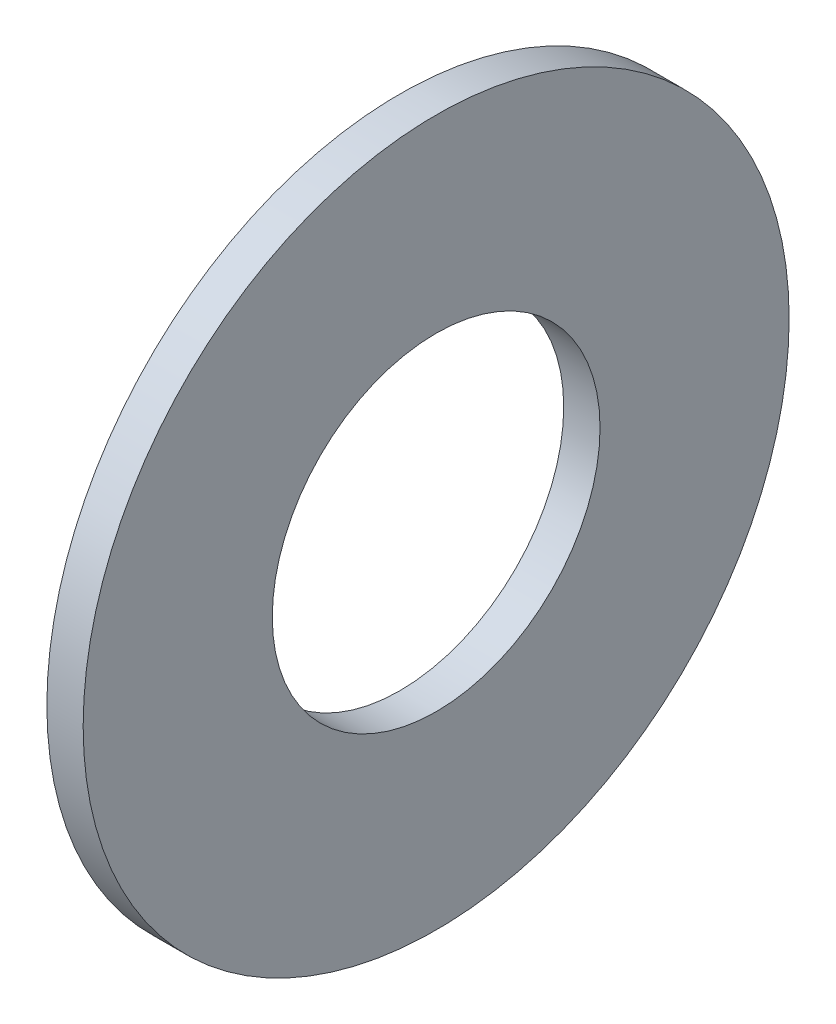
ISO-10303-21;
HEADER;
FILE_DESCRIPTION(('STEP AP214'),'2;1');
FILE_NAME('part.step','',(''),(''),'','','');
FILE_SCHEMA(('AUTOMOTIVE_DESIGN { 1 0 10303 214 1 1 1 1 }'));
ENDSEC;
DATA;
#1=APPLICATION_CONTEXT('core data for automotive mechanical design processes');
#2=APPLICATION_PROTOCOL_DEFINITION('international standard','automotive_design',2000,#1);
#3=PRODUCT_CONTEXT('',#1,'mechanical');
#4=PRODUCT('Part','Part','',(#3));
#5=PRODUCT_RELATED_PRODUCT_CATEGORY('part','',(#4));
#6=PRODUCT_DEFINITION_FORMATION('','',#4);
#7=PRODUCT_DEFINITION_CONTEXT('part definition',#1,'design');
#8=PRODUCT_DEFINITION('design','',#6,#7);
#9=PRODUCT_DEFINITION_SHAPE('','',#8);
#10=(LENGTH_UNIT() NAMED_UNIT(*) SI_UNIT(.MILLI.,.METRE.));
#11=(NAMED_UNIT(*) PLANE_ANGLE_UNIT() SI_UNIT($,.RADIAN.));
#12=(NAMED_UNIT(*) SI_UNIT($,.STERADIAN.) SOLID_ANGLE_UNIT());
#13=UNCERTAINTY_MEASURE_WITH_UNIT(LENGTH_MEASURE(1.E-05),#10,'distance_accuracy_value','');
#14=(GEOMETRIC_REPRESENTATION_CONTEXT(3) GLOBAL_UNCERTAINTY_ASSIGNED_CONTEXT((#13)) GLOBAL_UNIT_ASSIGNED_CONTEXT((#10,
#11,#12)) REPRESENTATION_CONTEXT('',''));
#15=CARTESIAN_POINT('',(0.,0.,0.));
#16=DIRECTION('',(0.,0.,1.));
#17=DIRECTION('',(1.,0.,0.));
#18=AXIS2_PLACEMENT_3D('',#15,#16,#17);
#19=CARTESIAN_POINT('',(-34.9249999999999,0.,0.));
#20=DIRECTION('',(-1.,0.,0.));
#21=DIRECTION('',(0.,0.,1.));
#22=AXIS2_PLACEMENT_3D('',#19,#20,#21);
#23=CYLINDRICAL_SURFACE('',#22,20.6375);
#24=CARTESIAN_POINT('',(0.,0.,0.));
#25=DIRECTION('',(-1.,0.,0.));
#26=DIRECTION('',(0.,0.,1.));
#27=AXIS2_PLACEMENT_3D('',#24,#25,#26);
#28=CIRCLE('',#27,20.6375);
#29=CARTESIAN_POINT('',(0.,0.,20.6375));
#30=VERTEX_POINT('',#29);
#31=EDGE_CURVE('E10',#30,#30,#28,.T.);
#32=ORIENTED_EDGE('',*,*,#31,.F.);
#33=EDGE_LOOP('',(#32));
#34=FACE_BOUND('',#33,.T.);
#35=CARTESIAN_POINT('',(-4.572,0.,0.));
#36=DIRECTION('',(-1.,0.,0.));
#37=DIRECTION('',(0.,0.,1.));
#38=AXIS2_PLACEMENT_3D('',#35,#36,#37);
#39=CIRCLE('',#38,20.6375);
#40=CARTESIAN_POINT('',(-4.572,0.,20.6375));
#41=VERTEX_POINT('',#40);
#42=EDGE_CURVE('E44',#41,#41,#39,.T.);
#43=ORIENTED_EDGE('',*,*,#42,.T.);
#44=EDGE_LOOP('',(#43));
#45=FACE_BOUND('',#44,.T.);
#46=ADVANCED_FACE('F30',(#34,#45),#23,.F.);
#47=CARTESIAN_POINT('',(0.,20.6375,0.));
#48=DIRECTION('',(-1.,0.,0.));
#49=DIRECTION('',(0.,0.,1.));
#50=AXIS2_PLACEMENT_3D('',#47,#48,#49);
#51=PLANE('',#50);
#52=CARTESIAN_POINT('',(0.,0.,0.));
#53=DIRECTION('',(-1.,0.,0.));
#54=DIRECTION('',(0.,0.,1.));
#55=AXIS2_PLACEMENT_3D('',#52,#53,#54);
#56=CIRCLE('',#55,44.45);
#57=CARTESIAN_POINT('',(0.,0.,44.45));
#58=VERTEX_POINT('',#57);
#59=EDGE_CURVE('E36',#58,#58,#56,.T.);
#60=ORIENTED_EDGE('',*,*,#59,.F.);
#61=EDGE_LOOP('',(#60));
#62=FACE_BOUND('',#61,.T.);
#63=ORIENTED_EDGE('',*,*,#31,.T.);
#64=EDGE_LOOP('',(#63));
#65=FACE_BOUND('',#64,.T.);
#66=ADVANCED_FACE('F59',(#62,#65),#51,.F.);
#67=CARTESIAN_POINT('',(-34.9249999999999,0.,0.));
#68=DIRECTION('',(-1.,0.,0.));
#69=DIRECTION('',(0.,0.,1.));
#70=AXIS2_PLACEMENT_3D('',#67,#68,#69);
#71=CYLINDRICAL_SURFACE('',#70,44.45);
#72=CARTESIAN_POINT('',(-4.572,0.,0.));
#73=DIRECTION('',(-1.,0.,0.));
#74=DIRECTION('',(0.,0.,1.));
#75=AXIS2_PLACEMENT_3D('',#72,#73,#74);
#76=CIRCLE('',#75,44.45);
#77=CARTESIAN_POINT('',(-4.572,0.,44.45));
#78=VERTEX_POINT('',#77);
#79=EDGE_CURVE('E40',#78,#78,#76,.T.);
#80=ORIENTED_EDGE('',*,*,#79,.F.);
#81=EDGE_LOOP('',(#80));
#82=FACE_BOUND('',#81,.T.);
#83=ORIENTED_EDGE('',*,*,#59,.T.);
#84=EDGE_LOOP('',(#83));
#85=FACE_BOUND('',#84,.T.);
#86=ADVANCED_FACE('F54',(#82,#85),#71,.T.);
#87=CARTESIAN_POINT('',(-4.572,44.45,0.));
#88=DIRECTION('',(1.,0.,0.));
#89=DIRECTION('',(0.,0.,-1.));
#90=AXIS2_PLACEMENT_3D('',#87,#88,#89);
#91=PLANE('',#90);
#92=ORIENTED_EDGE('',*,*,#42,.F.);
#93=EDGE_LOOP('',(#92));
#94=FACE_BOUND('',#93,.T.);
#95=ORIENTED_EDGE('',*,*,#79,.T.);
#96=EDGE_LOOP('',(#95));
#97=FACE_BOUND('',#96,.T.);
#98=ADVANCED_FACE('F51',(#94,#97),#91,.F.);
#99=CLOSED_SHELL('',(#46,#66,#86,#98));
#100=MANIFOLD_SOLID_BREP('B2',#99);
#101=ADVANCED_BREP_SHAPE_REPRESENTATION('',(#18,#100),#14);
#102=SHAPE_DEFINITION_REPRESENTATION(#9,#101);
ENDSEC;
END-ISO-10303-21;
